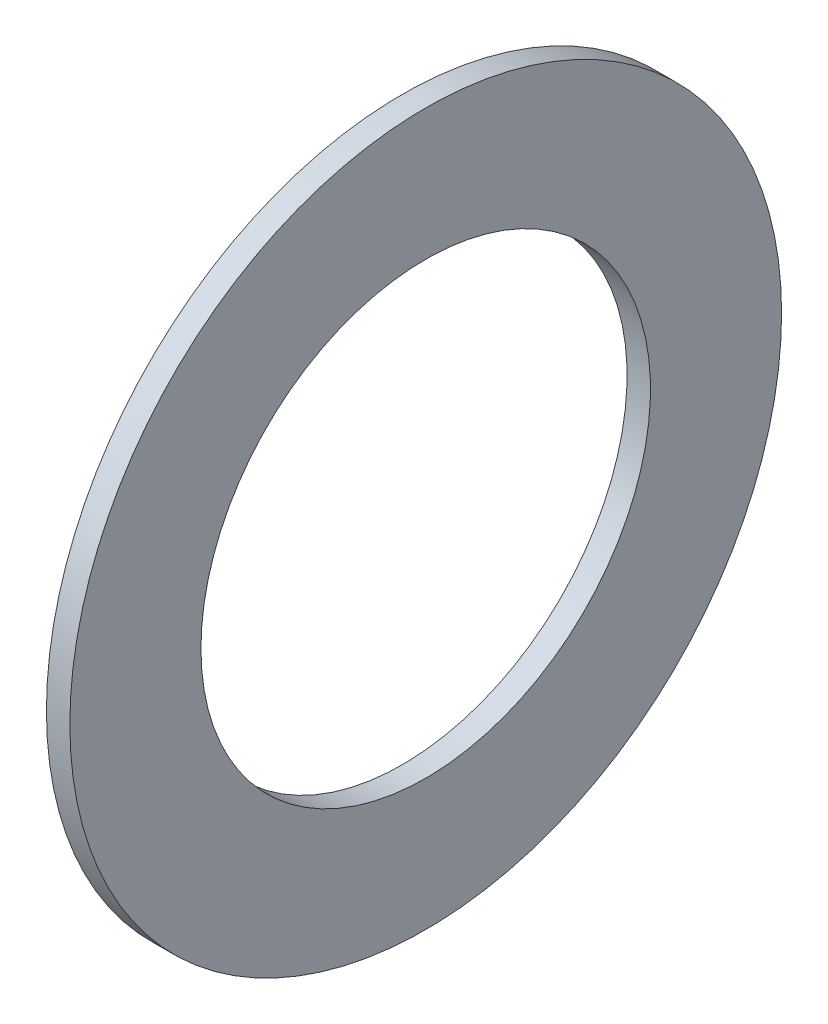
ISO-10303-21;
HEADER;
FILE_DESCRIPTION(('STEP AP214'),'2;1');
FILE_NAME('part.step','',(''),(''),'','','');
FILE_SCHEMA(('AUTOMOTIVE_DESIGN { 1 0 10303 214 1 1 1 1 }'));
ENDSEC;
DATA;
#1=APPLICATION_CONTEXT('core data for automotive mechanical design processes');
#2=APPLICATION_PROTOCOL_DEFINITION('international standard','automotive_design',2000,#1);
#3=PRODUCT_CONTEXT('',#1,'mechanical');
#4=PRODUCT('Part','Part','',(#3));
#5=PRODUCT_RELATED_PRODUCT_CATEGORY('part','',(#4));
#6=PRODUCT_DEFINITION_FORMATION('','',#4);
#7=PRODUCT_DEFINITION_CONTEXT('part definition',#1,'design');
#8=PRODUCT_DEFINITION('design','',#6,#7);
#9=PRODUCT_DEFINITION_SHAPE('','',#8);
#10=(LENGTH_UNIT() NAMED_UNIT(*) SI_UNIT(.MILLI.,.METRE.));
#11=(NAMED_UNIT(*) PLANE_ANGLE_UNIT() SI_UNIT($,.RADIAN.));
#12=(NAMED_UNIT(*) SI_UNIT($,.STERADIAN.) SOLID_ANGLE_UNIT());
#13=UNCERTAINTY_MEASURE_WITH_UNIT(LENGTH_MEASURE(1.E-05),#10,'distance_accuracy_value','');
#14=(GEOMETRIC_REPRESENTATION_CONTEXT(3) GLOBAL_UNCERTAINTY_ASSIGNED_CONTEXT((#13)) GLOBAL_UNIT_ASSIGNED_CONTEXT((#10,
#11,#12)) REPRESENTATION_CONTEXT('',''));
#15=CARTESIAN_POINT('',(0.,0.,0.));
#16=DIRECTION('',(0.,0.,1.));
#17=DIRECTION('',(1.,0.,0.));
#18=AXIS2_PLACEMENT_3D('',#15,#16,#17);
#19=CARTESIAN_POINT('',(-1.,15.2,0.));
#20=DIRECTION('',(1.,0.,0.));
#21=DIRECTION('',(0.,0.,-1.));
#22=AXIS2_PLACEMENT_3D('',#19,#20,#21);
#23=PLANE('',#22);
#24=CARTESIAN_POINT('',(-0.999999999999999,0.,0.));
#25=DIRECTION('',(-1.,0.,0.));
#26=DIRECTION('',(0.,0.,1.));
#27=AXIS2_PLACEMENT_3D('',#24,#25,#26);
#28=CIRCLE('',#27,9.6);
#29=CARTESIAN_POINT('',(-0.999999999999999,0.,9.6));
#30=VERTEX_POINT('',#29);
#31=EDGE_CURVE('E10',#30,#30,#28,.T.);
#32=ORIENTED_EDGE('',*,*,#31,.F.);
#33=EDGE_LOOP('',(#32));
#34=FACE_BOUND('',#33,.T.);
#35=CARTESIAN_POINT('',(-1.,0.,0.));
#36=DIRECTION('',(-1.,0.,0.));
#37=DIRECTION('',(0.,0.,1.));
#38=AXIS2_PLACEMENT_3D('',#35,#36,#37);
#39=CIRCLE('',#38,15.2);
#40=CARTESIAN_POINT('',(-1.,0.,15.2));
#41=VERTEX_POINT('',#40);
#42=EDGE_CURVE('E44',#41,#41,#39,.T.);
#43=ORIENTED_EDGE('',*,*,#42,.T.);
#44=EDGE_LOOP('',(#43));
#45=FACE_BOUND('',#44,.T.);
#46=ADVANCED_FACE('F30',(#34,#45),#23,.F.);
#47=CARTESIAN_POINT('',(-11.8056338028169,0.,0.));
#48=DIRECTION('',(-1.,0.,0.));
#49=DIRECTION('',(0.,0.,1.));
#50=AXIS2_PLACEMENT_3D('',#47,#48,#49);
#51=CYLINDRICAL_SURFACE('',#50,9.6);
#52=CARTESIAN_POINT('',(0.,0.,0.));
#53=DIRECTION('',(-1.,0.,0.));
#54=DIRECTION('',(0.,0.,1.));
#55=AXIS2_PLACEMENT_3D('',#52,#53,#54);
#56=CIRCLE('',#55,9.6);
#57=CARTESIAN_POINT('',(0.,0.,9.6));
#58=VERTEX_POINT('',#57);
#59=EDGE_CURVE('E36',#58,#58,#56,.T.);
#60=ORIENTED_EDGE('',*,*,#59,.F.);
#61=EDGE_LOOP('',(#60));
#62=FACE_BOUND('',#61,.T.);
#63=ORIENTED_EDGE('',*,*,#31,.T.);
#64=EDGE_LOOP('',(#63));
#65=FACE_BOUND('',#64,.T.);
#66=ADVANCED_FACE('F59',(#62,#65),#51,.F.);
#67=CARTESIAN_POINT('',(0.,15.2,0.));
#68=DIRECTION('',(-1.,0.,0.));
#69=DIRECTION('',(0.,0.,1.));
#70=AXIS2_PLACEMENT_3D('',#67,#68,#69);
#71=PLANE('',#70);
#72=CARTESIAN_POINT('',(0.,0.,0.));
#73=DIRECTION('',(-1.,0.,0.));
#74=DIRECTION('',(0.,0.,1.));
#75=AXIS2_PLACEMENT_3D('',#72,#73,#74);
#76=CIRCLE('',#75,15.2);
#77=CARTESIAN_POINT('',(0.,0.,15.2));
#78=VERTEX_POINT('',#77);
#79=EDGE_CURVE('E40',#78,#78,#76,.T.);
#80=ORIENTED_EDGE('',*,*,#79,.F.);
#81=EDGE_LOOP('',(#80));
#82=FACE_BOUND('',#81,.T.);
#83=ORIENTED_EDGE('',*,*,#59,.T.);
#84=EDGE_LOOP('',(#83));
#85=FACE_BOUND('',#84,.T.);
#86=ADVANCED_FACE('F54',(#82,#85),#71,.F.);
#87=CARTESIAN_POINT('',(-11.8056338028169,0.,0.));
#88=DIRECTION('',(-1.,0.,0.));
#89=DIRECTION('',(0.,0.,1.));
#90=AXIS2_PLACEMENT_3D('',#87,#88,#89);
#91=CYLINDRICAL_SURFACE('',#90,15.2);
#92=ORIENTED_EDGE('',*,*,#42,.F.);
#93=EDGE_LOOP('',(#92));
#94=FACE_BOUND('',#93,.T.);
#95=ORIENTED_EDGE('',*,*,#79,.T.);
#96=EDGE_LOOP('',(#95));
#97=FACE_BOUND('',#96,.T.);
#98=ADVANCED_FACE('F51',(#94,#97),#91,.T.);
#99=CLOSED_SHELL('',(#46,#66,#86,#98));
#100=MANIFOLD_SOLID_BREP('B2',#99);
#101=ADVANCED_BREP_SHAPE_REPRESENTATION('',(#18,#100),#14);
#102=SHAPE_DEFINITION_REPRESENTATION(#9,#101);
ENDSEC;
END-ISO-10303-21;
